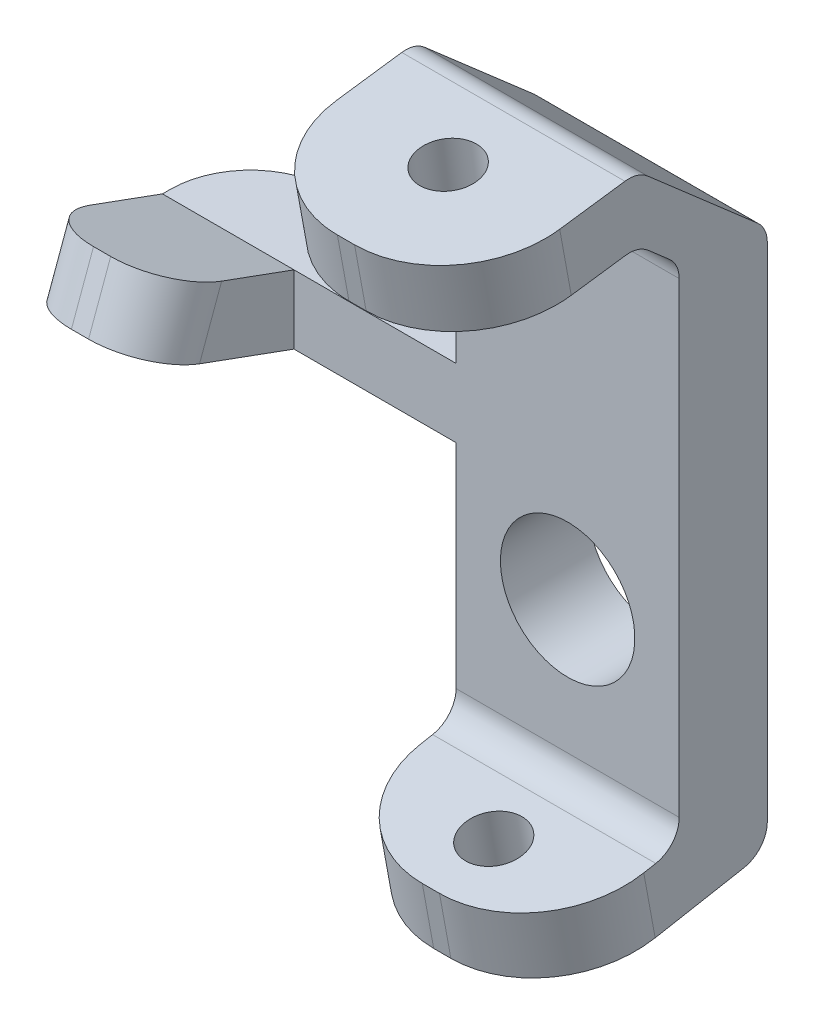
from build123d import *

# Parameters (mm, degrees)
MAIN_PIECE_DEPTH                        = 19.558
SKETCH1_R                               = 14.9225
SPINDLE_SHAFT_HOLE_DEPTH                = 89.80395066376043
BOTTOM_BALL_JOINT_MOUNT_DEPTH           = 14.224
TOP_ARM_DEPTH                           = 14.224
SKETCH2_W                               = 64.0027140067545
SKETCH2_H                               = 30.45832541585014
TOP_ARM1_DEPTH                          = 14.224
FILLET1_R                               = 6.35
FILLET2_R                               = 6.35
FILLET3_R                               = 6.35
TOP_BALL_JOINT_MOUNT_DEPTH              = 14.224
FILLET4_R                               = 6.35
FILLET5_R                               = 6.35
FILLET6_R                               = 6.35
FILLET7_R                               = 22.86
TIE_ROD_ARM_DEPTH                       = 19.558
TIE_ROD_MOUNT_DEPTH                     = 29.209999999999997
FILLET10_R                              = 12.7
BOTTOM_BALL_JOINT_MOUNT_EXTENSION_DEPTH = 49.535079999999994
FILLET11_R                              = 22.86
FILLET12_R                              = 17.779999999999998
SKETCH3_R                               = 6.3500000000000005
CUT_EXTRUDE1_DEPTH                      = 50.8
SKETCH4_R                               = 6.3500000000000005
CUT_EXTRUDE2_DEPTH                      = 50.8


with BuildPart() as part:
    # 3DSketch1 → Main piece (new body)
    with BuildSketch(Plane(origin=(24.76753999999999, 83.00719999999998, -2.97e-15), x_dir=(-0.35987665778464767, -0.9329998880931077, 0), z_dir=(-2e-17, -1e-17, -1))):
        Polygon((0, 0), (17.82651903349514, 46.21622409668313), (137.64460386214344, 0), (119.8180848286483, -46.21622409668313), align=None)
    extrude(amount=-MAIN_PIECE_DEPTH)

    # Sketch1 → Spindle Shaft hole (cut, through all)
    with BuildSketch(Plane.XY):
        with Locations(Location((0, 0, 0), (0, 0, 180))):
            Circle(SKETCH1_R)
    extrude(amount=SPINDLE_SHAFT_HOLE_DEPTH, mode=Mode.SUBTRACT)

    # 3DSketch3 → Bottom ball joint mount (add, along a direction that is not the sketch's normal)
    with BuildSketch(Plane(origin=(24.76753999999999, -53.34154144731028, 43.18508752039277), x_dir=(-0.748344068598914, 0.11974605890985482, -0.6524124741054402), z_dir=(0, 0.9835698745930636, 0.18052784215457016))):
        Polygon((0, 0), (37.06928330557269, 32.857151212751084), (66.19292124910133, 0), (29.123637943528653, -32.857151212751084), align=None)
    extrude(amount=BOTTOM_BALL_JOINT_MOUNT_DEPTH, dir=(0, 1, 0))

    # 3DSketch4 → Top arm (add, along a direction that is not the sketch's normal)
    with BuildSketch(Plane(origin=(24.76753999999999, 59.943999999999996, -1.5e-15), x_dir=(-0.7924173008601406, 0.40063760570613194, 0.45996122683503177), z_dir=(0, 0.7540603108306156, -0.6568051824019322))):
        Polygon((0, 0), (39.25245439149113, -30.215376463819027), (62.51135600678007, 0), (23.258901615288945, 30.215376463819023), align=None)
    extrude(amount=TOP_ARM_DEPTH, dir=(0, 1, 0))

    # Sketch2 → Top arm1 (cut)
    with BuildSketch(Plane(origin=(-4.66e-15, 42.17244044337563, -36.733238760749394), x_dir=(1, 6e-17, -5e-17), z_dir=(0, 0.7540603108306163, -0.6568051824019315))):
        with Locations((1.5286505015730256, -60.87808899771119)):
            Rectangle(SKETCH2_W, SKETCH2_H)
    extrude(amount=TOP_ARM1_DEPTH, mode=Mode.SUBTRACT)

    # Fillet1
    fillet1_edges = [part.edges().sort_by_distance(p)[0] for p in [
        (-2.78e-15, 74.16800000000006, -4.68e-15),
    ]]
    fillet(fillet1_edges, radius=FILLET1_R)

    # Fillet2
    fillet2_edges = [part.edges().sort_by_distance(p)[0] for p in [
        (-8.81e-15, 76.97950176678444, 19.557999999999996),
    ]]
    fillet(fillet2_edges, radius=FILLET2_R)

    # Fillet3
    fillet3_edges = [part.edges().sort_by_distance(p)[0] for p in [
        (-7.11e-15, -45.4152, -7.4e-16),
    ]]
    fillet(fillet3_edges, radius=FILLET3_R)

    # 3DSketch5 → Top ball joint mount (add, along a direction that is not the sketch's normal)
    with BuildSketch(Plane(origin=(-24.767540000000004, 99.21239999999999, 28.75279999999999), x_dir=(0.7751269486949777, -0.0854539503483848, 0.6259998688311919), z_dir=(0, 0.9908110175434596, 0.13525356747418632))):
        Polygon((0, 0), (38.3959754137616, 31.2965369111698), (63.905764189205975, 0), (25.509788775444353, -31.296536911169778), align=None)
    extrude(amount=-TOP_BALL_JOINT_MOUNT_DEPTH, dir=(0, 0.9835698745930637, 0.1805278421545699))

    # Fillet4
    fillet4_edges = [part.edges().sort_by_distance(p)[0] for p in [
        (-7.21e-15, 84.88740175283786, 28.63684663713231),
    ]]
    fillet(fillet4_edges, radius=FILLET4_R)

    # Fillet5
    fillet5_edges = [part.edges().sort_by_distance(p)[0] for p in [
        (0, 99.21239999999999, 28.752799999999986),
    ]]
    fillet(fillet5_edges, radius=FILLET5_R)

    # Fillet6
    fillet6_edges = [part.edges().sort_by_distance(p)[0] for p in [
        (-1.235e-14, -34.780943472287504, 19.557999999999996),
    ]]
    fillet(fillet6_edges, radius=FILLET6_R)

    # Fillet7
    fillet7_edges = [part.edges().sort_by_distance(p)[0] for p in [
        (24.767539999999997, 86.75625105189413, 67.4738859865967),
        (-24.767539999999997, 86.75625105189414, 67.47388598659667),
    ]]
    fillet(fillet7_edges, radius=FILLET7_R)

    # 3DSketch6 → Tie rod arm (add)
    with BuildSketch(Plane(origin=(-89.94139999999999, 33.019999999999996, 0), x_dir=(0.9859463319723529, -0.16706235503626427, 0), z_dir=(0, 0, 1))):
        Polygon((0, 0), (2.546030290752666, -15.025822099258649), (91.22342371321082, 1.73e-15), (88.67739342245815, 15.025822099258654), align=None)
    extrude(amount=TIE_ROD_ARM_DEPTH)

    # 3DSketch7 → Tie rod mount (add)
    with BuildSketch(Plane(origin=(-89.94139999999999, 33.019999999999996, 19.558), x_dir=(0, -0.09760969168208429, 0.9952247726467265), z_dir=(1, 0, 4.2e-16))):
        Polygon((0, 0), (1.4875717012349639, 15.167225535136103), (33.06812769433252, 0), (26.87023317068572, -12.904994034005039), align=None)
    extrude(amount=TIE_ROD_MOUNT_DEPTH)

    # Fillet10
    fillet10_edges = [part.edges().sort_by_distance(p)[0] for p in [
        (-60.73140000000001, 36.51640241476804, 50.01389702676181),
        (-89.9414, 36.51640241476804, 50.013897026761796),
    ]]
    fillet(fillet10_edges, radius=FILLET10_R)

    # 3DSketch8 → Bottom ball joint mount extension (add)
    with BuildSketch(Plane(origin=(-24.767540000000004, -39.11754144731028, 43.18508752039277), x_dir=(0, -0.9629923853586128, 0.26952859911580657), z_dir=(-1, 0, 0))):
        Polygon((0, 0), (3.0000404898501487, 6.141001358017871), (15.5705033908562, 0), (13.697603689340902, -3.833774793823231), align=None)
    extrude(amount=-BOTTOM_BALL_JOINT_MOUNT_EXTENSION_DEPTH)

    # Fillet11
    fillet11_edges = [part.edges().sort_by_distance(p)[0] for p in [
        (-24.767540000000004, -47.23159987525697, 48.64460263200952),
        (24.76753999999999, -47.23159987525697, 48.64460263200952),
    ]]
    fillet(fillet11_edges, radius=FILLET11_R)

    # Fillet12
    fillet12_edges = [part.edges().sort_by_distance(p)[0] for p in [
        (-89.94139999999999, 25.400000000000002, 0),
    ]]
    fillet(fillet12_edges, radius=FILLET12_R)

    # Sketch3 → Cut-Extrude1 (cut)
    with BuildSketch(Plane(origin=(1.6451e-13, 101.25063879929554, 13.821515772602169), x_dir=(1, -1.6e-15, -2.2e-16), z_dir=(1.609823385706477e-15, 0.9908110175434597, 0.1352535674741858))):
        with Locations(Location((-1.7846e-13, -32.56172111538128, 0), (0, 0, 270))):
            Circle(SKETCH3_R)
    extrude(amount=-CUT_EXTRUDE1_DEPTH, mode=Mode.SUBTRACT)

    # Sketch4 → Cut-Extrude2 (cut)
    with BuildSketch(Plane(origin=(-8.5e-16, -30.174669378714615, -5.538363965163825), x_dir=(1, -3e-17, -1e-17), z_dir=(0, 0.9835698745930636, 0.18052784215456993))):
        with Locations(Location((0, -42.182440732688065, 0), (0, 0, 270))):
            Circle(SKETCH4_R)
    extrude(amount=-CUT_EXTRUDE2_DEPTH, mode=Mode.SUBTRACT)


solid = part.part
